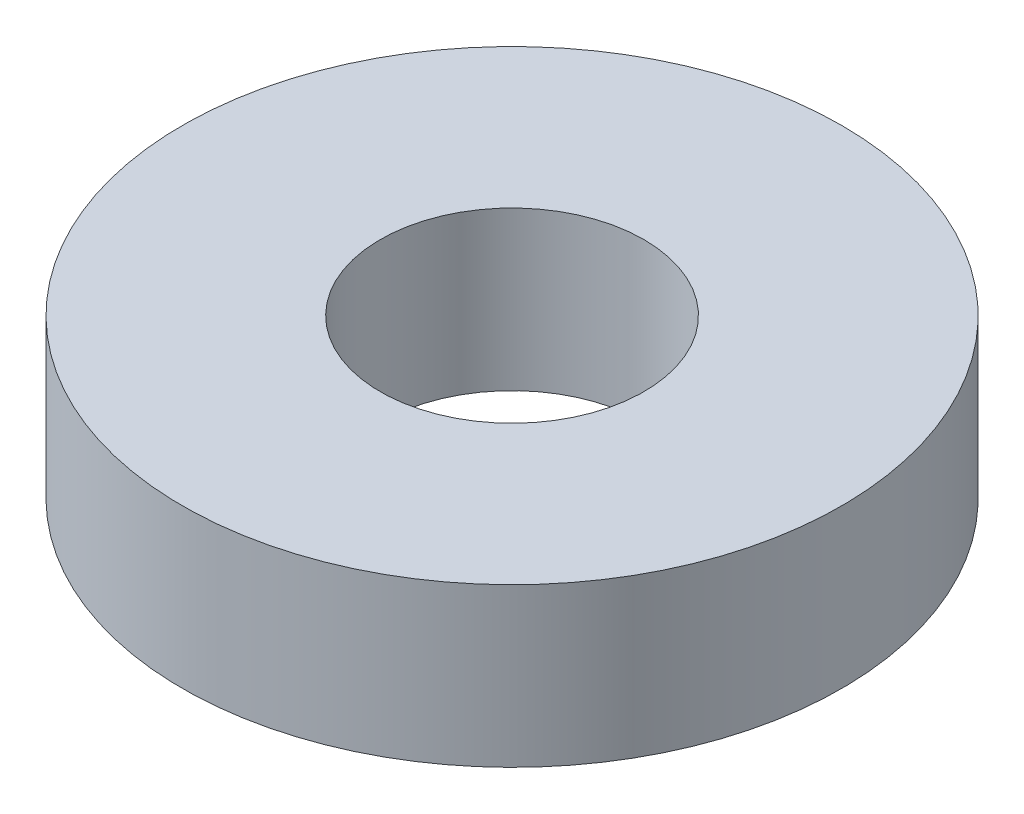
ISO-10303-21;
HEADER;
FILE_DESCRIPTION(('STEP AP214'),'2;1');
FILE_NAME('part.step','',(''),(''),'','','');
FILE_SCHEMA(('AUTOMOTIVE_DESIGN { 1 0 10303 214 1 1 1 1 }'));
ENDSEC;
DATA;
#1=APPLICATION_CONTEXT('core data for automotive mechanical design processes');
#2=APPLICATION_PROTOCOL_DEFINITION('international standard','automotive_design',2000,#1);
#3=PRODUCT_CONTEXT('',#1,'mechanical');
#4=PRODUCT('Part','Part','',(#3));
#5=PRODUCT_RELATED_PRODUCT_CATEGORY('part','',(#4));
#6=PRODUCT_DEFINITION_FORMATION('','',#4);
#7=PRODUCT_DEFINITION_CONTEXT('part definition',#1,'design');
#8=PRODUCT_DEFINITION('design','',#6,#7);
#9=PRODUCT_DEFINITION_SHAPE('','',#8);
#10=(LENGTH_UNIT() NAMED_UNIT(*) SI_UNIT(.MILLI.,.METRE.));
#11=(NAMED_UNIT(*) PLANE_ANGLE_UNIT() SI_UNIT($,.RADIAN.));
#12=(NAMED_UNIT(*) SI_UNIT($,.STERADIAN.) SOLID_ANGLE_UNIT());
#13=UNCERTAINTY_MEASURE_WITH_UNIT(LENGTH_MEASURE(1.E-05),#10,'distance_accuracy_value','');
#14=(GEOMETRIC_REPRESENTATION_CONTEXT(3) GLOBAL_UNCERTAINTY_ASSIGNED_CONTEXT((#13)) GLOBAL_UNIT_ASSIGNED_CONTEXT((#10,
#11,#12)) REPRESENTATION_CONTEXT('',''));
#15=CARTESIAN_POINT('',(0.,0.,0.));
#16=DIRECTION('',(0.,0.,1.));
#17=DIRECTION('',(1.,0.,0.));
#18=AXIS2_PLACEMENT_3D('',#15,#16,#17);
#19=CARTESIAN_POINT('',(0.,1.905,0.));
#20=DIRECTION('',(0.,1.,0.));
#21=DIRECTION('',(0.,0.,1.));
#22=AXIS2_PLACEMENT_3D('',#19,#20,#21);
#23=PLANE('',#22);
#24=CARTESIAN_POINT('',(0.,1.905,0.));
#25=DIRECTION('',(0.,1.,0.));
#26=DIRECTION('',(0.,0.,1.));
#27=AXIS2_PLACEMENT_3D('',#24,#25,#26);
#28=CIRCLE('',#27,7.9375);
#29=CARTESIAN_POINT('',(0.,1.905,-7.9375));
#30=VERTEX_POINT('',#29);
#31=EDGE_CURVE('E10',#30,#30,#28,.T.);
#32=ORIENTED_EDGE('',*,*,#31,.T.);
#33=EDGE_LOOP('',(#32));
#34=FACE_BOUND('',#33,.T.);
#35=CARTESIAN_POINT('',(0.,1.905,0.));
#36=DIRECTION('',(0.,1.,0.));
#37=DIRECTION('',(0.,0.,1.));
#38=AXIS2_PLACEMENT_3D('',#35,#36,#37);
#39=CIRCLE('',#38,3.175);
#40=CARTESIAN_POINT('',(0.,1.905,-3.175));
#41=VERTEX_POINT('',#40);
#42=EDGE_CURVE('E45',#41,#41,#39,.T.);
#43=ORIENTED_EDGE('',*,*,#42,.F.);
#44=EDGE_LOOP('',(#43));
#45=FACE_BOUND('',#44,.T.);
#46=ADVANCED_FACE('F34',(#34,#45),#23,.T.);
#47=CARTESIAN_POINT('',(0.,-1.905,0.));
#48=DIRECTION('',(0.,1.,0.));
#49=DIRECTION('',(0.,0.,1.));
#50=AXIS2_PLACEMENT_3D('',#47,#48,#49);
#51=PLANE('',#50);
#52=CARTESIAN_POINT('',(0.,-1.905,0.));
#53=DIRECTION('',(0.,1.,0.));
#54=DIRECTION('',(0.,0.,1.));
#55=AXIS2_PLACEMENT_3D('',#52,#53,#54);
#56=CIRCLE('',#55,7.9375);
#57=CARTESIAN_POINT('',(0.,-1.905,-7.9375));
#58=VERTEX_POINT('',#57);
#59=EDGE_CURVE('E38',#58,#58,#56,.T.);
#60=ORIENTED_EDGE('',*,*,#59,.F.);
#61=EDGE_LOOP('',(#60));
#62=FACE_BOUND('',#61,.T.);
#63=CARTESIAN_POINT('',(0.,-1.905,0.));
#64=DIRECTION('',(0.,1.,0.));
#65=DIRECTION('',(0.,0.,1.));
#66=AXIS2_PLACEMENT_3D('',#63,#64,#65);
#67=CIRCLE('',#66,3.175);
#68=CARTESIAN_POINT('',(0.,-1.905,-3.175));
#69=VERTEX_POINT('',#68);
#70=EDGE_CURVE('E47',#69,#69,#67,.T.);
#71=ORIENTED_EDGE('',*,*,#70,.T.);
#72=EDGE_LOOP('',(#71));
#73=FACE_BOUND('',#72,.T.);
#74=ADVANCED_FACE('F57',(#62,#73),#51,.F.);
#75=CARTESIAN_POINT('',(0.,1.905,0.));
#76=DIRECTION('',(0.,-1.,0.));
#77=DIRECTION('',(0.,0.,-1.));
#78=AXIS2_PLACEMENT_3D('',#75,#76,#77);
#79=CYLINDRICAL_SURFACE('',#78,7.9375);
#80=CARTESIAN_POINT('',(0.,1.905,-7.9375));
#81=CARTESIAN_POINT('',(0.,1.8653125,-7.9375));
#82=CARTESIAN_POINT('',(0.,1.825625,-7.9375));
#83=CARTESIAN_POINT('',(0.,1.74625,-7.9375));
#84=CARTESIAN_POINT('',(0.,1.7065625,-7.9375));
#85=CARTESIAN_POINT('',(0.,1.6271875,-7.9375));
#86=CARTESIAN_POINT('',(0.,1.5875,-7.9375));
#87=CARTESIAN_POINT('',(0.,1.508125,-7.9375));
#88=CARTESIAN_POINT('',(0.,1.4684375,-7.9375));
#89=CARTESIAN_POINT('',(0.,1.3890625,-7.9375));
#90=CARTESIAN_POINT('',(0.,1.349375,-7.9375));
#91=CARTESIAN_POINT('',(0.,1.27,-7.9375));
#92=CARTESIAN_POINT('',(0.,1.2303125,-7.9375));
#93=CARTESIAN_POINT('',(0.,1.1509375,-7.9375));
#94=CARTESIAN_POINT('',(0.,1.11125,-7.9375));
#95=CARTESIAN_POINT('',(0.,1.031875,-7.9375));
#96=CARTESIAN_POINT('',(0.,0.9921875,-7.9375));
#97=CARTESIAN_POINT('',(0.,0.9128125,-7.9375));
#98=CARTESIAN_POINT('',(0.,0.873125,-7.9375));
#99=CARTESIAN_POINT('',(0.,0.79375,-7.9375));
#100=CARTESIAN_POINT('',(0.,0.7540625,-7.9375));
#101=CARTESIAN_POINT('',(0.,0.6746875,-7.9375));
#102=CARTESIAN_POINT('',(0.,0.635,-7.9375));
#103=CARTESIAN_POINT('',(0.,0.555625,-7.9375));
#104=CARTESIAN_POINT('',(0.,0.5159375,-7.9375));
#105=CARTESIAN_POINT('',(0.,0.4365625,-7.9375));
#106=CARTESIAN_POINT('',(0.,0.396875,-7.9375));
#107=CARTESIAN_POINT('',(0.,0.3175,-7.9375));
#108=CARTESIAN_POINT('',(0.,0.2778125,-7.9375));
#109=CARTESIAN_POINT('',(0.,0.1984375,-7.9375));
#110=CARTESIAN_POINT('',(0.,0.15875,-7.9375));
#111=CARTESIAN_POINT('',(0.,0.0793749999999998,-7.9375));
#112=CARTESIAN_POINT('',(0.,0.0396874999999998,-7.9375));
#113=CARTESIAN_POINT('',(0.,-0.0396875,-7.9375));
#114=CARTESIAN_POINT('',(0.,-0.0793749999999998,-7.9375));
#115=CARTESIAN_POINT('',(0.,-0.15875,-7.9375));
#116=CARTESIAN_POINT('',(0.,-0.1984375,-7.9375));
#117=CARTESIAN_POINT('',(0.,-0.2778125,-7.9375));
#118=CARTESIAN_POINT('',(0.,-0.3175,-7.9375));
#119=CARTESIAN_POINT('',(0.,-0.396875,-7.9375));
#120=CARTESIAN_POINT('',(0.,-0.4365625,-7.9375));
#121=CARTESIAN_POINT('',(0.,-0.5159375,-7.9375));
#122=CARTESIAN_POINT('',(0.,-0.555625,-7.9375));
#123=CARTESIAN_POINT('',(0.,-0.635,-7.9375));
#124=CARTESIAN_POINT('',(0.,-0.6746875,-7.9375));
#125=CARTESIAN_POINT('',(0.,-0.7540625,-7.9375));
#126=CARTESIAN_POINT('',(0.,-0.79375,-7.9375));
#127=CARTESIAN_POINT('',(0.,-0.873125,-7.9375));
#128=CARTESIAN_POINT('',(0.,-0.9128125,-7.9375));
#129=CARTESIAN_POINT('',(0.,-0.9921875,-7.9375));
#130=CARTESIAN_POINT('',(0.,-1.031875,-7.9375));
#131=CARTESIAN_POINT('',(0.,-1.11125,-7.9375));
#132=CARTESIAN_POINT('',(0.,-1.1509375,-7.9375));
#133=CARTESIAN_POINT('',(0.,-1.2303125,-7.9375));
#134=CARTESIAN_POINT('',(0.,-1.27,-7.9375));
#135=CARTESIAN_POINT('',(0.,-1.349375,-7.9375));
#136=CARTESIAN_POINT('',(0.,-1.3890625,-7.9375));
#137=CARTESIAN_POINT('',(0.,-1.4684375,-7.9375));
#138=CARTESIAN_POINT('',(0.,-1.508125,-7.9375));
#139=CARTESIAN_POINT('',(0.,-1.5875,-7.9375));
#140=CARTESIAN_POINT('',(0.,-1.6271875,-7.9375));
#141=CARTESIAN_POINT('',(0.,-1.7065625,-7.9375));
#142=CARTESIAN_POINT('',(0.,-1.74625,-7.9375));
#143=CARTESIAN_POINT('',(0.,-1.825625,-7.9375));
#144=CARTESIAN_POINT('',(0.,-1.8653125,-7.9375));
#145=CARTESIAN_POINT('',(0.,-1.905,-7.9375));
#146=B_SPLINE_CURVE_WITH_KNOTS('',3,(#80,#81,#82,#83,#84,#85,#86,#87,#88,#89,#90,#91,#92,#93,
#94,#95,#96,#97,#98,#99,#100,#101,#102,#103,#104,#105,#106,#107,#108,#109,#110,#111,#112,#113,
#114,#115,#116,#117,#118,#119,#120,#121,#122,#123,#124,#125,#126,#127,#128,#129,#130,#131,#132,
#133,#134,#135,#136,#137,#138,#139,#140,#141,#142,#143,#144,#145),.UNSPECIFIED.,.F.,.F.,(4,2,2,
2,2,2,2,2,2,2,2,2,2,2,2,2,2,2,2,2,2,2,2,2,2,2,2,2,2,2,2,2,4),(0.,0.1190625,0.238125,0.3571875,
0.47625,0.5953125,0.714375,0.8334375,0.9525,1.0715625,1.190625,1.3096875,1.42875,1.5478125,
1.666875,1.7859375,1.905,2.0240625,2.143125,2.2621875,2.38125,2.5003125,2.619375,2.7384375,
2.8575,2.9765625,3.095625,3.2146875,3.33375,3.4528125,3.571875,3.6909375,3.81),.UNSPECIFIED.);
#147=EDGE_CURVE('BSEAM36',#30,#58,#146,.T.);
#148=ORIENTED_EDGE('',*,*,#31,.F.);
#149=ORIENTED_EDGE('',*,*,#59,.T.);
#150=ORIENTED_EDGE('',*,*,#147,.T.);
#151=ORIENTED_EDGE('',*,*,#147,.F.);
#152=EDGE_LOOP('',(#148,#150,#149,#151));
#153=FACE_BOUND('',#152,.T.);
#154=ADVANCED_FACE('F36',(#153),#79,.T.);
#155=CARTESIAN_POINT('',(0.,1.905,0.));
#156=DIRECTION('',(0.,-1.,0.));
#157=DIRECTION('',(0.,0.,-1.));
#158=AXIS2_PLACEMENT_3D('',#155,#156,#157);
#159=CYLINDRICAL_SURFACE('',#158,3.175);
#160=CARTESIAN_POINT('',(0.,1.905,-3.175));
#161=CARTESIAN_POINT('',(0.,1.8653125,-3.175));
#162=CARTESIAN_POINT('',(0.,1.825625,-3.175));
#163=CARTESIAN_POINT('',(0.,1.74625,-3.175));
#164=CARTESIAN_POINT('',(0.,1.7065625,-3.175));
#165=CARTESIAN_POINT('',(0.,1.6271875,-3.175));
#166=CARTESIAN_POINT('',(0.,1.5875,-3.175));
#167=CARTESIAN_POINT('',(0.,1.508125,-3.175));
#168=CARTESIAN_POINT('',(0.,1.4684375,-3.175));
#169=CARTESIAN_POINT('',(0.,1.3890625,-3.175));
#170=CARTESIAN_POINT('',(0.,1.349375,-3.175));
#171=CARTESIAN_POINT('',(0.,1.27,-3.175));
#172=CARTESIAN_POINT('',(0.,1.2303125,-3.175));
#173=CARTESIAN_POINT('',(0.,1.1509375,-3.175));
#174=CARTESIAN_POINT('',(0.,1.11125,-3.175));
#175=CARTESIAN_POINT('',(0.,1.031875,-3.175));
#176=CARTESIAN_POINT('',(0.,0.9921875,-3.175));
#177=CARTESIAN_POINT('',(0.,0.9128125,-3.175));
#178=CARTESIAN_POINT('',(0.,0.873125,-3.175));
#179=CARTESIAN_POINT('',(0.,0.79375,-3.175));
#180=CARTESIAN_POINT('',(0.,0.7540625,-3.175));
#181=CARTESIAN_POINT('',(0.,0.6746875,-3.175));
#182=CARTESIAN_POINT('',(0.,0.635,-3.175));
#183=CARTESIAN_POINT('',(0.,0.555625,-3.175));
#184=CARTESIAN_POINT('',(0.,0.5159375,-3.175));
#185=CARTESIAN_POINT('',(0.,0.4365625,-3.175));
#186=CARTESIAN_POINT('',(0.,0.396875,-3.175));
#187=CARTESIAN_POINT('',(0.,0.3175,-3.175));
#188=CARTESIAN_POINT('',(0.,0.2778125,-3.175));
#189=CARTESIAN_POINT('',(0.,0.1984375,-3.175));
#190=CARTESIAN_POINT('',(0.,0.15875,-3.175));
#191=CARTESIAN_POINT('',(0.,0.0793749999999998,-3.175));
#192=CARTESIAN_POINT('',(0.,0.0396874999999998,-3.175));
#193=CARTESIAN_POINT('',(0.,-0.0396875,-3.175));
#194=CARTESIAN_POINT('',(0.,-0.0793749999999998,-3.175));
#195=CARTESIAN_POINT('',(0.,-0.15875,-3.175));
#196=CARTESIAN_POINT('',(0.,-0.1984375,-3.175));
#197=CARTESIAN_POINT('',(0.,-0.2778125,-3.175));
#198=CARTESIAN_POINT('',(0.,-0.3175,-3.175));
#199=CARTESIAN_POINT('',(0.,-0.396875,-3.175));
#200=CARTESIAN_POINT('',(0.,-0.4365625,-3.175));
#201=CARTESIAN_POINT('',(0.,-0.5159375,-3.175));
#202=CARTESIAN_POINT('',(0.,-0.555625,-3.175));
#203=CARTESIAN_POINT('',(0.,-0.635,-3.175));
#204=CARTESIAN_POINT('',(0.,-0.6746875,-3.175));
#205=CARTESIAN_POINT('',(0.,-0.7540625,-3.175));
#206=CARTESIAN_POINT('',(0.,-0.79375,-3.175));
#207=CARTESIAN_POINT('',(0.,-0.873125,-3.175));
#208=CARTESIAN_POINT('',(0.,-0.9128125,-3.175));
#209=CARTESIAN_POINT('',(0.,-0.9921875,-3.175));
#210=CARTESIAN_POINT('',(0.,-1.031875,-3.175));
#211=CARTESIAN_POINT('',(0.,-1.11125,-3.175));
#212=CARTESIAN_POINT('',(0.,-1.1509375,-3.175));
#213=CARTESIAN_POINT('',(0.,-1.2303125,-3.175));
#214=CARTESIAN_POINT('',(0.,-1.27,-3.175));
#215=CARTESIAN_POINT('',(0.,-1.349375,-3.175));
#216=CARTESIAN_POINT('',(0.,-1.3890625,-3.175));
#217=CARTESIAN_POINT('',(0.,-1.4684375,-3.175));
#218=CARTESIAN_POINT('',(0.,-1.508125,-3.175));
#219=CARTESIAN_POINT('',(0.,-1.5875,-3.175));
#220=CARTESIAN_POINT('',(0.,-1.6271875,-3.175));
#221=CARTESIAN_POINT('',(0.,-1.7065625,-3.175));
#222=CARTESIAN_POINT('',(0.,-1.74625,-3.175));
#223=CARTESIAN_POINT('',(0.,-1.825625,-3.175));
#224=CARTESIAN_POINT('',(0.,-1.8653125,-3.175));
#225=CARTESIAN_POINT('',(0.,-1.905,-3.175));
#226=B_SPLINE_CURVE_WITH_KNOTS('',3,(#160,#161,#162,#163,#164,#165,#166,#167,#168,#169,#170,
#171,#172,#173,#174,#175,#176,#177,#178,#179,#180,#181,#182,#183,#184,#185,#186,#187,#188,#189,
#190,#191,#192,#193,#194,#195,#196,#197,#198,#199,#200,#201,#202,#203,#204,#205,#206,#207,#208,
#209,#210,#211,#212,#213,#214,#215,#216,#217,#218,#219,#220,#221,#222,#223,#224,#225),
.UNSPECIFIED.,.F.,.F.,(4,2,2,2,2,2,2,2,2,2,2,2,2,2,2,2,2,2,2,2,2,2,2,2,2,2,2,2,2,2,2,2,4),(0.,
0.1190625,0.238125,0.3571875,0.47625,0.5953125,0.714375,0.8334375,0.9525,1.0715625,1.190625,
1.3096875,1.42875,1.5478125,1.666875,1.7859375,1.905,2.0240625,2.143125,2.2621875,2.38125,
2.5003125,2.619375,2.7384375,2.8575,2.9765625,3.095625,3.2146875,3.33375,3.4528125,3.571875,
3.6909375,3.81),.UNSPECIFIED.);
#227=EDGE_CURVE('BSEAM53',#41,#69,#226,.T.);
#228=ORIENTED_EDGE('',*,*,#42,.T.);
#229=ORIENTED_EDGE('',*,*,#70,.F.);
#230=ORIENTED_EDGE('',*,*,#227,.T.);
#231=ORIENTED_EDGE('',*,*,#227,.F.);
#232=EDGE_LOOP('',(#228,#230,#229,#231));
#233=FACE_BOUND('',#232,.T.);
#234=ADVANCED_FACE('F53',(#233),#159,.F.);
#235=CLOSED_SHELL('',(#46,#74,#154,#234));
#236=MANIFOLD_SOLID_BREP('B2',#235);
#237=ADVANCED_BREP_SHAPE_REPRESENTATION('',(#18,#236),#14);
#238=SHAPE_DEFINITION_REPRESENTATION(#9,#237);
ENDSEC;
END-ISO-10303-21;
